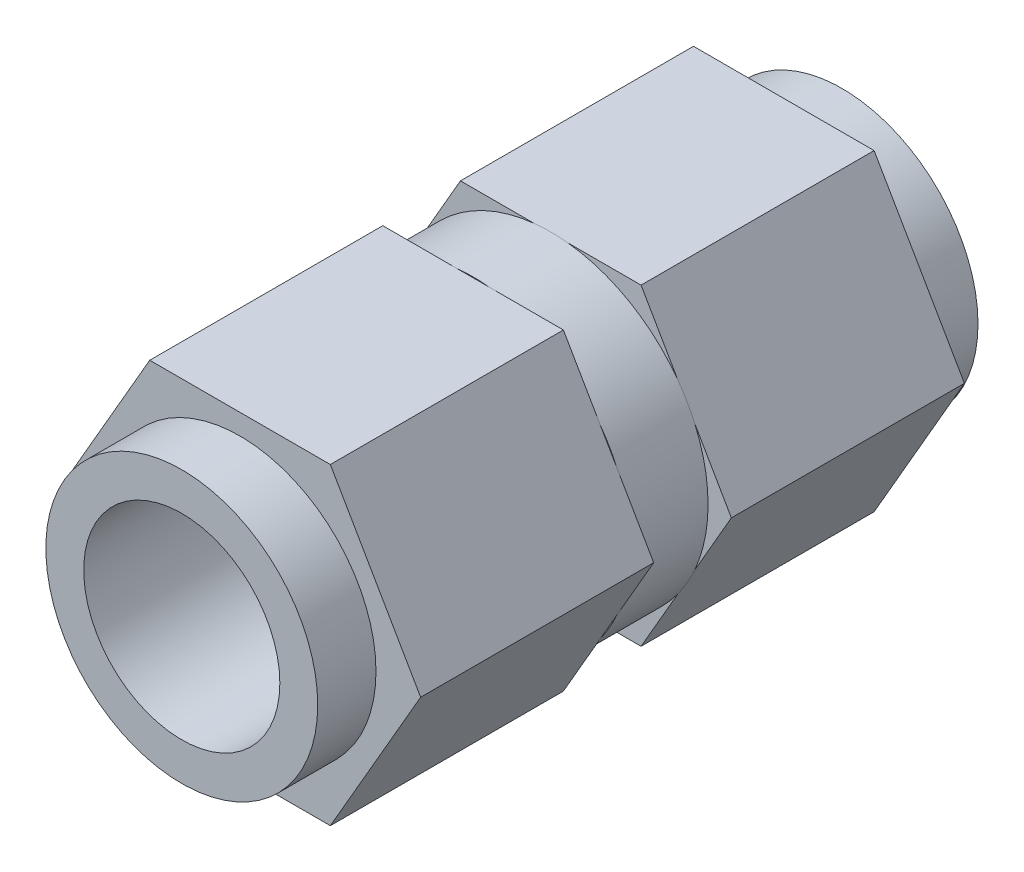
from build123d import *

# Parameters (mm, degrees)
BOSS_EXTRUDE1_DEPTH = 6
SKETCH2_R           = 4.050000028
BOSS_EXTRUDE2_DEPTH = 2
BOSS_EXTRUDE3_DEPTH = 6
SKETCH5_R           = 3.5
BOSS_EXTRUDE4_DEPTH = 1.5
SKETCH6_R           = 2
CUT_EXTRUDE2_DEPTH  = 1
SKETCH7_R           = 0.75
CUT_EXTRUDE3_DEPTH  = 1.5
BOSS_EXTRUDE6_START = 1.5
SKETCH9_R           = 3.5
BOSS_EXTRUDE6_DEPTH = 1.5
SKETCH10_R          = 2.525
CUT_EXTRUDE4_DEPTH  = 15


with BuildPart() as part:
    # Sketch1 → Boss-Extrude1 (new body)
    with BuildSketch(Plane.XY):
        Polygon((4.65, 0), (2.325, 4.027018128), (-2.325, 4.027018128), (-4.65, 0), (-2.325, -4.027018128), (2.325, -4.027018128), align=None)
    extrude(amount=BOSS_EXTRUDE1_DEPTH)

    # Sketch2 → Boss-Extrude2 (add)
    with BuildSketch(Plane.XY.offset(6)):
        with Locations(Location((0, 0, 0), (0, 0, 203.893270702))):
            Circle(SKETCH2_R)
    extrude(amount=BOSS_EXTRUDE2_DEPTH)

    # Sketch3 → Boss-Extrude3 (add)
    with BuildSketch(Plane.XY.offset(8)):
        Polygon((4.65, 0), (2.325, 4.027018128), (-2.325, 4.027018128), (-4.65, 0), (-2.325, -4.027018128), (2.325, -4.027018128), align=None)
    extrude(amount=BOSS_EXTRUDE3_DEPTH)

    # Sketch5 → Boss-Extrude4 (add)
    with BuildSketch(Plane(origin=(0, 0, 0), x_dir=(-1, 0, 0), z_dir=(0, 0, -1))):
        with Locations(Location((0, 0, 0), (0, 0, 180))):
            Circle(SKETCH5_R)
    extrude(amount=BOSS_EXTRUDE4_DEPTH)

    # Sketch6 → Cut-Extrude2 (cut)
    with BuildSketch(Plane(origin=(0, 0, -1.5), x_dir=(-1, 0, 0), z_dir=(0, 0, -1))):
        Circle(SKETCH6_R)
    extrude(amount=-CUT_EXTRUDE2_DEPTH, mode=Mode.SUBTRACT)

    # Sketch7 → Cut-Extrude3 (cut)
    with BuildSketch(Plane(origin=(0, 0, -0.5), x_dir=(-1, 0, 0), z_dir=(0, 0, -1))):
        Circle(SKETCH7_R)
    extrude(amount=-CUT_EXTRUDE3_DEPTH, mode=Mode.SUBTRACT)

    # Sketch9 → Boss-Extrude6 (add)
    with BuildSketch(Plane.XY.offset(14).offset(BOSS_EXTRUDE6_START)):
        Circle(SKETCH9_R)
    extrude(amount=-BOSS_EXTRUDE6_DEPTH)

    # Sketch10 → Cut-Extrude4 (cut)
    with BuildSketch(Plane.XY.offset(15.5)):
        Circle(SKETCH10_R)
    extrude(amount=-CUT_EXTRUDE4_DEPTH, mode=Mode.SUBTRACT)


solid = part.part
